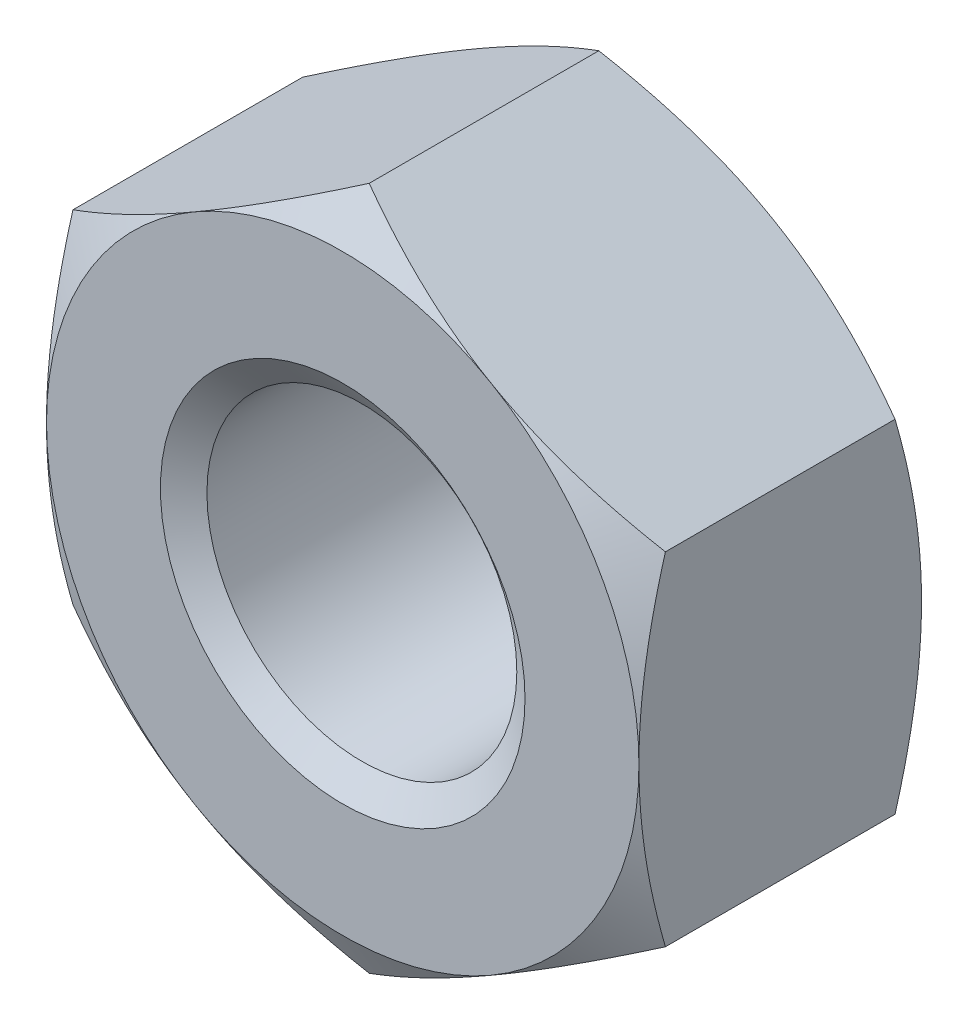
ISO-10303-21;
HEADER;
FILE_DESCRIPTION(('STEP AP214'),'2;1');
FILE_NAME('part.step','',(''),(''),'','','');
FILE_SCHEMA(('AUTOMOTIVE_DESIGN { 1 0 10303 214 1 1 1 1 }'));
ENDSEC;
DATA;
#1=APPLICATION_CONTEXT('core data for automotive mechanical design processes');
#2=APPLICATION_PROTOCOL_DEFINITION('international standard','automotive_design',2000,#1);
#3=PRODUCT_CONTEXT('',#1,'mechanical');
#4=PRODUCT('Part','Part','',(#3));
#5=PRODUCT_RELATED_PRODUCT_CATEGORY('part','',(#4));
#6=PRODUCT_DEFINITION_FORMATION('','',#4);
#7=PRODUCT_DEFINITION_CONTEXT('part definition',#1,'design');
#8=PRODUCT_DEFINITION('design','',#6,#7);
#9=PRODUCT_DEFINITION_SHAPE('','',#8);
#10=(LENGTH_UNIT() NAMED_UNIT(*) SI_UNIT(.MILLI.,.METRE.));
#11=(NAMED_UNIT(*) PLANE_ANGLE_UNIT() SI_UNIT($,.RADIAN.));
#12=(NAMED_UNIT(*) SI_UNIT($,.STERADIAN.) SOLID_ANGLE_UNIT());
#13=UNCERTAINTY_MEASURE_WITH_UNIT(LENGTH_MEASURE(1.E-05),#10,'distance_accuracy_value','');
#14=(GEOMETRIC_REPRESENTATION_CONTEXT(3) GLOBAL_UNCERTAINTY_ASSIGNED_CONTEXT((#13)) GLOBAL_UNIT_ASSIGNED_CONTEXT((#10,
#11,#12)) REPRESENTATION_CONTEXT('',''));
#15=CARTESIAN_POINT('',(0.,0.,0.));
#16=DIRECTION('',(0.,0.,1.));
#17=DIRECTION('',(1.,0.,0.));
#18=AXIS2_PLACEMENT_3D('',#15,#16,#17);
#19=CARTESIAN_POINT('',(0.,0.,-6.2));
#20=DIRECTION('',(0.,0.,1.));
#21=DIRECTION('',(1.,0.,0.));
#22=AXIS2_PLACEMENT_3D('',#19,#20,#21);
#23=CYLINDRICAL_SURFACE('',#22,3.4);
#24=CARTESIAN_POINT('',(0.,0.,-0.420124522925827));
#25=DIRECTION('',(0.,0.,1.));
#26=DIRECTION('',(1.,0.,0.));
#27=AXIS2_PLACEMENT_3D('',#24,#25,#26);
#28=CIRCLE('',#27,3.4);
#29=CARTESIAN_POINT('',(3.4,0.,-0.420124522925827));
#30=VERTEX_POINT('',#29);
#31=EDGE_CURVE('E175',#30,#30,#28,.F.);
#32=CARTESIAN_POINT('',(0.,0.,-5.75447547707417));
#33=DIRECTION('',(0.,0.,-1.));
#34=DIRECTION('',(-1.,0.,0.));
#35=AXIS2_PLACEMENT_3D('',#32,#33,#34);
#36=CIRCLE('',#35,3.4);
#37=CARTESIAN_POINT('',(3.4,0.,-5.75447547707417));
#38=VERTEX_POINT('',#37);
#39=EDGE_CURVE('E40',#38,#38,#36,.F.);
#40=CARTESIAN_POINT('',(3.4,0.,-0.420124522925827));
#41=CARTESIAN_POINT('',(3.4,0.,-0.475690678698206));
#42=CARTESIAN_POINT('',(3.4,0.,-0.531256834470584));
#43=CARTESIAN_POINT('',(3.4,0.,-0.642389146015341));
#44=CARTESIAN_POINT('',(3.4,0.,-0.69795530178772));
#45=CARTESIAN_POINT('',(3.4,0.,-0.809087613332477));
#46=CARTESIAN_POINT('',(3.4,0.,-0.864653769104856));
#47=CARTESIAN_POINT('',(3.4,0.,-0.975786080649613));
#48=CARTESIAN_POINT('',(3.4,0.,-1.03135223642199));
#49=CARTESIAN_POINT('',(3.4,0.,-1.14248454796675));
#50=CARTESIAN_POINT('',(3.4,0.,-1.19805070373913));
#51=CARTESIAN_POINT('',(3.4,0.,-1.30918301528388));
#52=CARTESIAN_POINT('',(3.4,0.,-1.36474917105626));
#53=CARTESIAN_POINT('',(3.4,0.,-1.47588148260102));
#54=CARTESIAN_POINT('',(3.4,0.,-1.5314476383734));
#55=CARTESIAN_POINT('',(3.4,0.,-1.64257994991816));
#56=CARTESIAN_POINT('',(3.4,0.,-1.69814610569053));
#57=CARTESIAN_POINT('',(3.4,0.,-1.80927841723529));
#58=CARTESIAN_POINT('',(3.4,0.,-1.86484457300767));
#59=CARTESIAN_POINT('',(3.4,0.,-1.97597688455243));
#60=CARTESIAN_POINT('',(3.4,0.,-2.03154304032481));
#61=CARTESIAN_POINT('',(3.4,0.,-2.14267535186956));
#62=CARTESIAN_POINT('',(3.4,0.,-2.19824150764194));
#63=CARTESIAN_POINT('',(3.4,0.,-2.3093738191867));
#64=CARTESIAN_POINT('',(3.4,0.,-2.36493997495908));
#65=CARTESIAN_POINT('',(3.4,0.,-2.47607228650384));
#66=CARTESIAN_POINT('',(3.4,0.,-2.53163844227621));
#67=CARTESIAN_POINT('',(3.4,0.,-2.64277075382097));
#68=CARTESIAN_POINT('',(3.4,0.,-2.69833690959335));
#69=CARTESIAN_POINT('',(3.4,0.,-2.80946922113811));
#70=CARTESIAN_POINT('',(3.4,0.,-2.86503537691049));
#71=CARTESIAN_POINT('',(3.4,0.,-2.97616768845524));
#72=CARTESIAN_POINT('',(3.4,0.,-3.03173384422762));
#73=CARTESIAN_POINT('',(3.4,0.,-3.14286615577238));
#74=CARTESIAN_POINT('',(3.4,0.,-3.19843231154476));
#75=CARTESIAN_POINT('',(3.4,0.,-3.30956462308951));
#76=CARTESIAN_POINT('',(3.4,0.,-3.36513077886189));
#77=CARTESIAN_POINT('',(3.4,0.,-3.47626309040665));
#78=CARTESIAN_POINT('',(3.4,0.,-3.53182924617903));
#79=CARTESIAN_POINT('',(3.4,0.,-3.64296155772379));
#80=CARTESIAN_POINT('',(3.4,0.,-3.69852771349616));
#81=CARTESIAN_POINT('',(3.4,0.,-3.80966002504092));
#82=CARTESIAN_POINT('',(3.4,0.,-3.8652261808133));
#83=CARTESIAN_POINT('',(3.4,0.,-3.97635849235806));
#84=CARTESIAN_POINT('',(3.4,0.,-4.03192464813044));
#85=CARTESIAN_POINT('',(3.4,0.,-4.14305695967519));
#86=CARTESIAN_POINT('',(3.4,0.,-4.19862311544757));
#87=CARTESIAN_POINT('',(3.4,0.,-4.30975542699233));
#88=CARTESIAN_POINT('',(3.4,0.,-4.36532158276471));
#89=CARTESIAN_POINT('',(3.4,0.,-4.47645389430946));
#90=CARTESIAN_POINT('',(3.4,0.,-4.53202005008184));
#91=CARTESIAN_POINT('',(3.4,0.,-4.6431523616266));
#92=CARTESIAN_POINT('',(3.4,0.,-4.69871851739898));
#93=CARTESIAN_POINT('',(3.4,0.,-4.80985082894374));
#94=CARTESIAN_POINT('',(3.4,0.,-4.86541698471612));
#95=CARTESIAN_POINT('',(3.4,0.,-4.97654929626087));
#96=CARTESIAN_POINT('',(3.4,0.,-5.03211545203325));
#97=CARTESIAN_POINT('',(3.4,0.,-5.14324776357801));
#98=CARTESIAN_POINT('',(3.4,0.,-5.19881391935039));
#99=CARTESIAN_POINT('',(3.4,0.,-5.30994623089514));
#100=CARTESIAN_POINT('',(3.4,0.,-5.36551238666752));
#101=CARTESIAN_POINT('',(3.4,0.,-5.47664469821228));
#102=CARTESIAN_POINT('',(3.4,0.,-5.53221085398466));
#103=CARTESIAN_POINT('',(3.4,0.,-5.64334316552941));
#104=CARTESIAN_POINT('',(3.4,0.,-5.69890932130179));
#105=CARTESIAN_POINT('',(3.4,0.,-5.75447547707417));
#106=B_SPLINE_CURVE_WITH_KNOTS('',3,(#40,#41,#42,#43,#44,#45,#46,#47,#48,#49,#50,#51,#52,#53,
#54,#55,#56,#57,#58,#59,#60,#61,#62,#63,#64,#65,#66,#67,#68,#69,#70,#71,#72,#73,#74,#75,#76,#77,
#78,#79,#80,#81,#82,#83,#84,#85,#86,#87,#88,#89,#90,#91,#92,#93,#94,#95,#96,#97,#98,#99,#100,
#101,#102,#103,#104,#105),.UNSPECIFIED.,.F.,.F.,(4,2,2,2,2,2,2,2,2,2,2,2,2,2,2,2,2,2,2,2,2,2,2,
2,2,2,2,2,2,2,2,2,4),(0.,0.166698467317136,0.333396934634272,0.500095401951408,
0.666793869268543,0.833492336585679,1.00019080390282,1.16688927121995,1.33358773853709,
1.50028620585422,1.66698467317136,1.83368314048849,2.00038160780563,2.16708007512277,
2.3337785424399,2.50047700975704,2.66717547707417,2.83387394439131,3.00057241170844,
3.16727087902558,3.33396934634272,3.50066781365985,3.66736628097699,3.83406474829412,
4.00076321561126,4.1674616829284,4.33416015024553,4.50085861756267,4.6675570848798,
4.83425555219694,5.00095401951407,5.16765248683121,5.33435095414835),.UNSPECIFIED.);
#107=EDGE_CURVE('BSEAM35',#30,#38,#106,.T.);
#108=ORIENTED_EDGE('',*,*,#31,.F.);
#109=ORIENTED_EDGE('',*,*,#39,.F.);
#110=ORIENTED_EDGE('',*,*,#107,.T.);
#111=ORIENTED_EDGE('',*,*,#107,.F.);
#112=EDGE_LOOP('',(#108,#110,#109,#111));
#113=FACE_BOUND('',#112,.T.);
#114=ADVANCED_FACE('F35',(#113),#23,.F.);
#115=CARTESIAN_POINT('',(0.,7.50555349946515,-6.2));
#116=DIRECTION('',(0.,0.,-1.));
#117=DIRECTION('',(-1.,0.,0.));
#118=AXIS2_PLACEMENT_3D('',#115,#116,#117);
#119=PLANE('',#118);
#120=CARTESIAN_POINT('',(0.,0.,-6.2));
#121=DIRECTION('',(0.,0.,-1.));
#122=DIRECTION('',(-1.,0.,0.));
#123=AXIS2_PLACEMENT_3D('',#120,#121,#122);
#124=CIRCLE('',#123,6.5);
#125=CARTESIAN_POINT('',(-6.5,0.,-6.2));
#126=VERTEX_POINT('',#125);
#127=CARTESIAN_POINT('',(-3.25000000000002,-5.62916512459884,-6.2));
#128=VERTEX_POINT('',#127);
#129=EDGE_CURVE('E171',#126,#128,#124,.F.);
#130=ORIENTED_EDGE('',*,*,#129,.F.);
#131=CARTESIAN_POINT('',(-3.25000000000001,5.62916512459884,-6.2));
#132=VERTEX_POINT('',#131);
#133=EDGE_CURVE('E153',#132,#126,#124,.F.);
#134=ORIENTED_EDGE('',*,*,#133,.F.);
#135=CARTESIAN_POINT('',(3.25000000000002,5.62916512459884,-6.2));
#136=VERTEX_POINT('',#135);
#137=EDGE_CURVE('E170',#136,#132,#124,.F.);
#138=ORIENTED_EDGE('',*,*,#137,.F.);
#139=CARTESIAN_POINT('',(0.,0.,-6.2));
#140=DIRECTION('',(0.,0.,1.));
#141=DIRECTION('',(1.,0.,0.));
#142=AXIS2_PLACEMENT_3D('',#139,#140,#141);
#143=CIRCLE('',#142,6.5);
#144=CARTESIAN_POINT('',(6.5,0.,-6.2));
#145=VERTEX_POINT('',#144);
#146=EDGE_CURVE('E245',#145,#136,#143,.T.);
#147=ORIENTED_EDGE('',*,*,#146,.F.);
#148=CARTESIAN_POINT('',(3.25000000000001,-5.62916512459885,-6.2));
#149=VERTEX_POINT('',#148);
#150=EDGE_CURVE('E377',#149,#145,#124,.F.);
#151=ORIENTED_EDGE('',*,*,#150,.F.);
#152=EDGE_CURVE('E398',#128,#149,#124,.F.);
#153=ORIENTED_EDGE('',*,*,#152,.F.);
#154=EDGE_LOOP('',(#130,#134,#138,#147,#151,#153));
#155=FACE_BOUND('',#154,.T.);
#156=CARTESIAN_POINT('',(0.,0.,-6.2));
#157=DIRECTION('',(0.,0.,-1.));
#158=DIRECTION('',(-1.,0.,0.));
#159=AXIS2_PLACEMENT_3D('',#156,#157,#158);
#160=CIRCLE('',#159,4.);
#161=CARTESIAN_POINT('',(-4.,0.,-6.2));
#162=VERTEX_POINT('',#161);
#163=EDGE_CURVE('E178',#162,#162,#160,.F.);
#164=ORIENTED_EDGE('',*,*,#163,.T.);
#165=EDGE_LOOP('',(#164));
#166=FACE_BOUND('',#165,.T.);
#167=ADVANCED_FACE('F250',(#155,#166),#119,.T.);
#168=CARTESIAN_POINT('',(0.,7.50555349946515,0.));
#169=DIRECTION('',(0.,0.,-1.));
#170=DIRECTION('',(-1.,0.,0.));
#171=AXIS2_PLACEMENT_3D('',#168,#169,#170);
#172=PLANE('',#171);
#173=CARTESIAN_POINT('',(0.,0.,0.));
#174=DIRECTION('',(0.,0.,-1.));
#175=DIRECTION('',(-1.,0.,0.));
#176=AXIS2_PLACEMENT_3D('',#173,#174,#175);
#177=CIRCLE('',#176,6.5);
#178=CARTESIAN_POINT('',(-6.5,0.,0.));
#179=VERTEX_POINT('',#178);
#180=CARTESIAN_POINT('',(-3.25000000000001,5.62916512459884,0.));
#181=VERTEX_POINT('',#180);
#182=EDGE_CURVE('E11',#179,#181,#177,.T.);
#183=ORIENTED_EDGE('',*,*,#182,.F.);
#184=CARTESIAN_POINT('',(-3.25000000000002,-5.62916512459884,0.));
#185=VERTEX_POINT('',#184);
#186=EDGE_CURVE('E47',#185,#179,#177,.T.);
#187=ORIENTED_EDGE('',*,*,#186,.F.);
#188=CARTESIAN_POINT('',(3.25000000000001,-5.62916512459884,0.));
#189=VERTEX_POINT('',#188);
#190=EDGE_CURVE('E174',#189,#185,#177,.T.);
#191=ORIENTED_EDGE('',*,*,#190,.F.);
#192=CARTESIAN_POINT('',(6.5,0.,0.));
#193=VERTEX_POINT('',#192);
#194=EDGE_CURVE('E343',#193,#189,#177,.T.);
#195=ORIENTED_EDGE('',*,*,#194,.F.);
#196=CARTESIAN_POINT('',(0.,0.,0.));
#197=DIRECTION('',(0.,0.,1.));
#198=DIRECTION('',(1.,0.,0.));
#199=AXIS2_PLACEMENT_3D('',#196,#197,#198);
#200=CIRCLE('',#199,6.5);
#201=CARTESIAN_POINT('',(3.25000000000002,5.62916512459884,0.));
#202=VERTEX_POINT('',#201);
#203=EDGE_CURVE('E129',#193,#202,#200,.T.);
#204=ORIENTED_EDGE('',*,*,#203,.T.);
#205=EDGE_CURVE('E45',#181,#202,#177,.T.);
#206=ORIENTED_EDGE('',*,*,#205,.F.);
#207=EDGE_LOOP('',(#183,#187,#191,#195,#204,#206));
#208=FACE_BOUND('',#207,.T.);
#209=CARTESIAN_POINT('',(0.,0.,0.));
#210=DIRECTION('',(0.,0.,1.));
#211=DIRECTION('',(1.,0.,0.));
#212=AXIS2_PLACEMENT_3D('',#209,#210,#211);
#213=CIRCLE('',#212,4.);
#214=CARTESIAN_POINT('',(4.,0.,0.));
#215=VERTEX_POINT('',#214);
#216=EDGE_CURVE('E177',#215,#215,#213,.T.);
#217=ORIENTED_EDGE('',*,*,#216,.F.);
#218=EDGE_LOOP('',(#217));
#219=FACE_BOUND('',#218,.T.);
#220=ADVANCED_FACE('F302',(#208,#219),#172,.F.);
#221=CARTESIAN_POINT('',(0.,7.50555349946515,-6.2));
#222=DIRECTION('',(-0.500000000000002,0.866025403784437,0.));
#223=DIRECTION('',(-0.866025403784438,-0.500000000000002,0.));
#224=AXIS2_PLACEMENT_3D('',#221,#222,#223);
#225=PLANE('',#224);
#226=DIRECTION('',(0.,0.,1.));
#227=VECTOR('',#226,1.);
#228=CARTESIAN_POINT('',(-6.5,3.75277674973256,-6.2));
#229=LINE('',#228,#227);
#230=CARTESIAN_POINT('',(-6.5,3.7527767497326,-5.61944341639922));
#231=VERTEX_POINT('',#230);
#232=CARTESIAN_POINT('',(-6.5,3.75277674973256,-0.580556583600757));
#233=VERTEX_POINT('',#232);
#234=EDGE_CURVE('E165',#231,#233,#229,.T.);
#235=ORIENTED_EDGE('',*,*,#234,.T.);
#236=CARTESIAN_POINT('',(-6.5002,3.75266127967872,-0.580623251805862));
#237=CARTESIAN_POINT('',(-6.35732254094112,3.83515161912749,-0.53300442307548));
#238=CARTESIAN_POINT('',(-6.21391236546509,3.91794952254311,-0.487546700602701));
#239=CARTESIAN_POINT('',(-5.9259273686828,4.08421773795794,-0.401548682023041));
#240=CARTESIAN_POINT('',(-5.78135207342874,4.16768832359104,-0.361010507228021));
#241=CARTESIAN_POINT('',(-5.34531134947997,4.41943655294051,-0.247571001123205));
#242=CARTESIAN_POINT('',(-5.05212471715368,4.58870793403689,-0.183047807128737));
#243=CARTESIAN_POINT('',(-4.61337625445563,4.84201947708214,-0.10738658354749));
#244=CARTESIAN_POINT('',(-4.46912536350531,4.92530276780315,-0.085832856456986));
#245=CARTESIAN_POINT('',(-4.17997178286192,5.09224566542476,-0.0496903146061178));
#246=CARTESIAN_POINT('',(-4.03506915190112,5.17590523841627,-0.0351008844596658));
#247=CARTESIAN_POINT('',(-3.74501222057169,5.34336968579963,-0.0132587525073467));
#248=CARTESIAN_POINT('',(-3.5998583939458,5.42717428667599,-0.00599772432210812));
#249=CARTESIAN_POINT('',(-3.30942466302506,5.59485627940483,0.00103969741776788));
#250=CARTESIAN_POINT('',(-3.16414476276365,5.6787336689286,0.000816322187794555));
#251=CARTESIAN_POINT('',(-2.76612405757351,5.90853103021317,-0.0100834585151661));
#252=CARTESIAN_POINT('',(-2.51351353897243,6.05437578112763,-0.0283818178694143));
#253=CARTESIAN_POINT('',(-2.00997032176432,6.34509659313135,-0.0864063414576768));
#254=CARTESIAN_POINT('',(-1.75903939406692,6.48997163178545,-0.126152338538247));
#255=CARTESIAN_POINT('',(-1.25448277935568,6.78127752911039,-0.225505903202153));
#256=CARTESIAN_POINT('',(-1.00092075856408,6.92767163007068,-0.28553442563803));
#257=CARTESIAN_POINT('',(-0.49757806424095,7.21827667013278,-0.421774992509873));
#258=CARTESIAN_POINT('',(-0.24779094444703,7.3624913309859,-0.497955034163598));
#259=CARTESIAN_POINT('',(0.000200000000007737,7.50566896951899,-0.580623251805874));
#260=B_SPLINE_CURVE_WITH_KNOTS('',3,(#236,#237,#238,#239,#240,#241,#242,#243,#244,#245,#246,
#247,#248,#249,#250,#251,#252,#253,#254,#255,#256,#257,#258,#259),.UNSPECIFIED.,.F.,.F.,(4,2,2,
2,2,2,2,2,2,2,2,4),(0.,0.515105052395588,1.03043143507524,2.06322554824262,2.56697389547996,
3.07067772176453,3.57380860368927,4.0769239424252,4.9527935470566,5.82947446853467,
6.72559912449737,7.61996451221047),.UNSPECIFIED.);
#261=EDGE_CURVE('E134',#233,#181,#260,.T.);
#262=ORIENTED_EDGE('',*,*,#261,.T.);
#263=CARTESIAN_POINT('',(0.,7.50555349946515,-0.58055658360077));
#264=VERTEX_POINT('',#263);
#265=EDGE_CURVE('E54',#181,#264,#260,.T.);
#266=ORIENTED_EDGE('',*,*,#265,.T.);
#267=DIRECTION('',(0.,0.,1.));
#268=VECTOR('',#267,1.);
#269=CARTESIAN_POINT('',(0.,7.50555349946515,-6.2));
#270=LINE('',#269,#268);
#271=CARTESIAN_POINT('',(0.,7.50555349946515,-5.61944341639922));
#272=VERTEX_POINT('',#271);
#273=EDGE_CURVE('E150',#272,#264,#270,.T.);
#274=ORIENTED_EDGE('',*,*,#273,.F.);
#275=CARTESIAN_POINT('',(-6.5002,3.75266127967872,-5.61937674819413));
#276=CARTESIAN_POINT('',(-6.35732254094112,3.83515161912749,-5.66699557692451));
#277=CARTESIAN_POINT('',(-6.21391236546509,3.91794952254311,-5.71245329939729));
#278=CARTESIAN_POINT('',(-5.9259273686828,4.08421773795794,-5.79845131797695));
#279=CARTESIAN_POINT('',(-5.78135207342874,4.16768832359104,-5.83898949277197));
#280=CARTESIAN_POINT('',(-5.34531134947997,4.41943655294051,-5.95242899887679));
#281=CARTESIAN_POINT('',(-5.05212471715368,4.58870793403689,-6.01695219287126));
#282=CARTESIAN_POINT('',(-4.61337625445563,4.84201947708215,-6.09261341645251));
#283=CARTESIAN_POINT('',(-4.46912536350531,4.92530276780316,-6.11416714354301));
#284=CARTESIAN_POINT('',(-4.17997178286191,5.09224566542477,-6.15030968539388));
#285=CARTESIAN_POINT('',(-4.03506915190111,5.17590523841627,-6.16489911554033));
#286=CARTESIAN_POINT('',(-3.74501222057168,5.34336968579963,-6.18674124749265));
#287=CARTESIAN_POINT('',(-3.59985839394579,5.427174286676,-6.19400227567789));
#288=CARTESIAN_POINT('',(-3.30942466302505,5.59485627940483,-6.20103969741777));
#289=CARTESIAN_POINT('',(-3.16414476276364,5.6787336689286,-6.2008163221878));
#290=CARTESIAN_POINT('',(-2.76612405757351,5.90853103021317,-6.18991654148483));
#291=CARTESIAN_POINT('',(-2.51351353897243,6.05437578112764,-6.17161818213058));
#292=CARTESIAN_POINT('',(-2.00997032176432,6.34509659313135,-6.11359365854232));
#293=CARTESIAN_POINT('',(-1.75903939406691,6.48997163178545,-6.07384766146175));
#294=CARTESIAN_POINT('',(-1.25448277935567,6.78127752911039,-5.97449409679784));
#295=CARTESIAN_POINT('',(-1.00092075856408,6.92767163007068,-5.91446557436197));
#296=CARTESIAN_POINT('',(-0.497578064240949,7.21827667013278,-5.77822500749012));
#297=CARTESIAN_POINT('',(-0.247790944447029,7.3624913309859,-5.7020449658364));
#298=CARTESIAN_POINT('',(0.000200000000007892,7.50566896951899,-5.61937674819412));
#299=B_SPLINE_CURVE_WITH_KNOTS('',3,(#275,#276,#277,#278,#279,#280,#281,#282,#283,#284,#285,
#286,#287,#288,#289,#290,#291,#292,#293,#294,#295,#296,#297,#298),.UNSPECIFIED.,.F.,.F.,(4,2,2,
2,2,2,2,2,2,2,2,4),(0.,0.515105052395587,1.03043143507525,2.06322554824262,2.56697389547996,
3.07067772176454,3.57380860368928,4.0769239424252,4.95279354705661,5.82947446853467,
6.72559912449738,7.61996451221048),.UNSPECIFIED.);
#300=EDGE_CURVE('E168',#132,#272,#299,.T.);
#301=ORIENTED_EDGE('',*,*,#300,.F.);
#302=EDGE_CURVE('E260',#231,#132,#299,.T.);
#303=ORIENTED_EDGE('',*,*,#302,.F.);
#304=EDGE_LOOP('',(#235,#262,#266,#274,#301,#303));
#305=FACE_BOUND('',#304,.T.);
#306=ADVANCED_FACE('F37',(#305),#225,.T.);
#307=CARTESIAN_POINT('',(6.5,3.75277674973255,-6.2));
#308=DIRECTION('',(0.500000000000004,0.866025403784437,0.));
#309=DIRECTION('',(-0.866025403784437,0.500000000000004,0.));
#310=AXIS2_PLACEMENT_3D('',#307,#308,#309);
#311=PLANE('',#310);
#312=ORIENTED_EDGE('',*,*,#273,.T.);
#313=CARTESIAN_POINT('',(-0.000199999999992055,7.50566896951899,-0.580623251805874));
#314=CARTESIAN_POINT('',(0.142677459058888,7.42317863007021,-0.533004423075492));
#315=CARTESIAN_POINT('',(0.28608763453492,7.34038072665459,-0.487546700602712));
#316=CARTESIAN_POINT('',(0.574072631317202,7.17411251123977,-0.401548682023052));
#317=CARTESIAN_POINT('',(0.718647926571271,7.09064192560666,-0.361010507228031));
#318=CARTESIAN_POINT('',(1.15468865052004,6.8388936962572,-0.247571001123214));
#319=CARTESIAN_POINT('',(1.44787528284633,6.66962231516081,-0.183047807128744));
#320=CARTESIAN_POINT('',(1.88662374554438,6.41631077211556,-0.107386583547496));
#321=CARTESIAN_POINT('',(2.0308746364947,6.33302748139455,-0.0858328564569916));
#322=CARTESIAN_POINT('',(2.32002821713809,6.16608458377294,-0.0496903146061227));
#323=CARTESIAN_POINT('',(2.46493084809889,6.08242501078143,-0.0351008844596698));
#324=CARTESIAN_POINT('',(2.75498777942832,5.91496056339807,-0.0132587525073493));
#325=CARTESIAN_POINT('',(2.90014160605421,5.8311559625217,-0.00599772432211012));
#326=CARTESIAN_POINT('',(3.19057533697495,5.66347396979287,0.00103969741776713));
#327=CARTESIAN_POINT('',(3.33585523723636,5.5795965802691,0.00081632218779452));
#328=CARTESIAN_POINT('',(3.7338759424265,5.34979921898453,-0.0100834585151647));
#329=CARTESIAN_POINT('',(3.98648646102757,5.20395446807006,-0.0283818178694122));
#330=CARTESIAN_POINT('',(4.49002967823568,4.91323365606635,-0.0864063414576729));
#331=CARTESIAN_POINT('',(4.74096060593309,4.76835861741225,-0.126152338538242));
#332=CARTESIAN_POINT('',(5.24551722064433,4.4770527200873,-0.225505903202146));
#333=CARTESIAN_POINT('',(5.49907924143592,4.33065861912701,-0.285534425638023));
#334=CARTESIAN_POINT('',(6.00242193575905,4.04005357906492,-0.421774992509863));
#335=CARTESIAN_POINT('',(6.25220905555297,3.8958389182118,-0.497955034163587));
#336=CARTESIAN_POINT('',(6.5002,3.75266127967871,-0.580623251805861));
#337=B_SPLINE_CURVE_WITH_KNOTS('',3,(#313,#314,#315,#316,#317,#318,#319,#320,#321,#322,#323,
#324,#325,#326,#327,#328,#329,#330,#331,#332,#333,#334,#335,#336),.UNSPECIFIED.,.F.,.F.,(4,2,2,
2,2,2,2,2,2,2,2,4),(0.,0.515105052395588,1.03043143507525,2.06322554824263,2.56697389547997,
3.07067772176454,3.57380860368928,4.07692394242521,4.95279354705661,5.82947446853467,
6.72559912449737,7.61996451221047),.UNSPECIFIED.);
#338=EDGE_CURVE('E144',#264,#202,#337,.T.);
#339=ORIENTED_EDGE('',*,*,#338,.T.);
#340=CARTESIAN_POINT('',(6.5,3.75277674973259,-0.58055658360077));
#341=VERTEX_POINT('',#340);
#342=EDGE_CURVE('E61',#202,#341,#337,.T.);
#343=ORIENTED_EDGE('',*,*,#342,.T.);
#344=DIRECTION('',(0.,0.,1.));
#345=VECTOR('',#344,1.);
#346=CARTESIAN_POINT('',(6.5,3.75277674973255,-6.2));
#347=LINE('',#346,#345);
#348=CARTESIAN_POINT('',(6.5,3.75277674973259,-5.61944341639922));
#349=VERTEX_POINT('',#348);
#350=EDGE_CURVE('E143',#349,#341,#347,.T.);
#351=ORIENTED_EDGE('',*,*,#350,.F.);
#352=CARTESIAN_POINT('',(-0.000199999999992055,7.50566896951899,-5.61937674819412));
#353=CARTESIAN_POINT('',(0.142677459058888,7.42317863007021,-5.6669955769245));
#354=CARTESIAN_POINT('',(0.286087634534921,7.34038072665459,-5.71245329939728));
#355=CARTESIAN_POINT('',(0.574072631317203,7.17411251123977,-5.79845131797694));
#356=CARTESIAN_POINT('',(0.718647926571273,7.09064192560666,-5.83898949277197));
#357=CARTESIAN_POINT('',(1.15468865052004,6.8388936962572,-5.95242899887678));
#358=CARTESIAN_POINT('',(1.44787528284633,6.66962231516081,-6.01695219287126));
#359=CARTESIAN_POINT('',(1.88662374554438,6.41631077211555,-6.0926134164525));
#360=CARTESIAN_POINT('',(2.0308746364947,6.33302748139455,-6.11416714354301));
#361=CARTESIAN_POINT('',(2.3200282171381,6.16608458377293,-6.15030968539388));
#362=CARTESIAN_POINT('',(2.4649308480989,6.08242501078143,-6.16489911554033));
#363=CARTESIAN_POINT('',(2.75498777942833,5.91496056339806,-6.18674124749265));
#364=CARTESIAN_POINT('',(2.90014160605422,5.8311559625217,-6.19400227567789));
#365=CARTESIAN_POINT('',(3.19057533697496,5.66347396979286,-6.20103969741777));
#366=CARTESIAN_POINT('',(3.33585523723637,5.5795965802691,-6.2008163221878));
#367=CARTESIAN_POINT('',(3.7338759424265,5.34979921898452,-6.18991654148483));
#368=CARTESIAN_POINT('',(3.98648646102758,5.20395446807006,-6.17161818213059));
#369=CARTESIAN_POINT('',(4.49002967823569,4.91323365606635,-6.11359365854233));
#370=CARTESIAN_POINT('',(4.74096060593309,4.76835861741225,-6.07384766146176));
#371=CARTESIAN_POINT('',(5.24551722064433,4.4770527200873,-5.97449409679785));
#372=CARTESIAN_POINT('',(5.49907924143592,4.33065861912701,-5.91446557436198));
#373=CARTESIAN_POINT('',(6.00242193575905,4.04005357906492,-5.77822500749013));
#374=CARTESIAN_POINT('',(6.25220905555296,3.8958389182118,-5.70204496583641));
#375=CARTESIAN_POINT('',(6.5002,3.75266127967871,-5.61937674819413));
#376=B_SPLINE_CURVE_WITH_KNOTS('',3,(#352,#353,#354,#355,#356,#357,#358,#359,#360,#361,#362,
#363,#364,#365,#366,#367,#368,#369,#370,#371,#372,#373,#374,#375),.UNSPECIFIED.,.F.,.F.,(4,2,2,
2,2,2,2,2,2,2,2,4),(0.,0.515105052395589,1.03043143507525,2.06322554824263,2.56697389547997,
3.07067772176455,3.57380860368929,4.07692394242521,4.95279354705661,5.82947446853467,
6.72559912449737,7.61996451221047),.UNSPECIFIED.);
#377=EDGE_CURVE('E254',#136,#349,#376,.T.);
#378=ORIENTED_EDGE('',*,*,#377,.F.);
#379=EDGE_CURVE('E259',#272,#136,#376,.T.);
#380=ORIENTED_EDGE('',*,*,#379,.F.);
#381=EDGE_LOOP('',(#312,#339,#343,#351,#378,#380));
#382=FACE_BOUND('',#381,.T.);
#383=ADVANCED_FACE('F141',(#382),#311,.T.);
#384=CARTESIAN_POINT('',(6.5,3.75277674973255,-6.2));
#385=DIRECTION('',(-1.,0.,0.));
#386=DIRECTION('',(0.,0.,1.));
#387=AXIS2_PLACEMENT_3D('',#384,#385,#386);
#388=PLANE('',#387);
#389=CARTESIAN_POINT('',(6.5,-9.95291698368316,-3.11042358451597));
#390=CARTESIAN_POINT('',(6.5,-9.66753022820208,-2.97250893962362));
#391=CARTESIAN_POINT('',(6.5,-9.38146872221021,-2.83596528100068));
#392=CARTESIAN_POINT('',(6.5,-8.80763137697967,-2.56640336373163));
#393=CARTESIAN_POINT('',(6.5,-8.51985525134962,-2.43338571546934));
#394=CARTESIAN_POINT('',(6.5,-7.94066929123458,-2.17095850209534));
#395=CARTESIAN_POINT('',(6.5,-7.64924808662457,-2.04157394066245));
#396=CARTESIAN_POINT('',(6.5,-7.06401043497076,-1.78836220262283));
#397=CARTESIAN_POINT('',(6.5,-6.77019411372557,-1.66453473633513));
#398=CARTESIAN_POINT('',(6.5,-6.1760515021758,-1.42244480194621));
#399=CARTESIAN_POINT('',(6.5,-5.87568957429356,-1.30426931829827));
#400=CARTESIAN_POINT('',(6.5,-5.27142269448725,-1.07717389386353));
#401=CARTESIAN_POINT('',(6.5,-4.96751735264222,-0.968254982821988));
#402=CARTESIAN_POINT('',(6.5,-4.35630541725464,-0.762599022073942));
#403=CARTESIAN_POINT('',(6.5,-4.04900762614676,-0.665836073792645));
#404=CARTESIAN_POINT('',(6.5,-3.43004022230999,-0.48763571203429));
#405=CARTESIAN_POINT('',(6.5,-3.11837202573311,-0.406193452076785));
#406=CARTESIAN_POINT('',(6.5,-2.49046594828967,-0.262584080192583));
#407=CARTESIAN_POINT('',(6.5,-2.17422687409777,-0.200422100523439));
#408=CARTESIAN_POINT('',(6.5,-1.53789167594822,-0.0995742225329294));
#409=CARTESIAN_POINT('',(6.5,-1.21779554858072,-0.0608883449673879));
#410=CARTESIAN_POINT('',(6.5,-0.737141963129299,-0.022946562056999));
#411=CARTESIAN_POINT('',(6.5,-0.57733688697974,-0.0136452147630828));
#412=CARTESIAN_POINT('',(6.5,-0.257468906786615,-0.00181408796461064));
#413=CARTESIAN_POINT('',(6.5,-0.0974060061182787,0.000715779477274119));
#414=CARTESIAN_POINT('',(6.5,0.222635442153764,-0.00106401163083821));
#415=CARTESIAN_POINT('',(6.5,0.382614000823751,-0.00537175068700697));
#416=CARTESIAN_POINT('',(6.5,0.702250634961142,-0.0207175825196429));
#417=CARTESIAN_POINT('',(6.5,0.861908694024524,-0.0317560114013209));
#418=CARTESIAN_POINT('',(6.5,1.24887053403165,-0.0664368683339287));
#419=CARTESIAN_POINT('',(6.5,1.47587694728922,-0.0934518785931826));
#420=CARTESIAN_POINT('',(6.5,1.92815030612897,-0.159589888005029));
#421=CARTESIAN_POINT('',(6.5,2.15341675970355,-0.198716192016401));
#422=CARTESIAN_POINT('',(6.5,2.6020242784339,-0.287689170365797));
#423=CARTESIAN_POINT('',(6.5,2.82536331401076,-0.337545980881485));
#424=CARTESIAN_POINT('',(6.5,3.26974354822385,-0.446458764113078));
#425=CARTESIAN_POINT('',(6.5,3.49078496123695,-0.505513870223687));
#426=CARTESIAN_POINT('',(6.5,3.93601414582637,-0.632954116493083));
#427=CARTESIAN_POINT('',(6.5,4.16014622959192,-0.701532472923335));
#428=CARTESIAN_POINT('',(6.5,4.6060413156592,-0.845465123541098));
#429=CARTESIAN_POINT('',(6.5,4.82780583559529,-0.920814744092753));
#430=CARTESIAN_POINT('',(6.5,5.26807593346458,-1.07673350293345));
#431=CARTESIAN_POINT('',(6.5,5.48659282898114,-1.15727087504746));
#432=CARTESIAN_POINT('',(6.5,5.92193123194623,-1.32307270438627));
#433=CARTESIAN_POINT('',(6.5,6.1387520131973,-1.40833907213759));
#434=CARTESIAN_POINT('',(6.5,6.35478510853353,-1.49550213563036));
#435=B_SPLINE_CURVE_WITH_KNOTS('',3,(#389,#390,#391,#392,#393,#394,#395,#396,#397,#398,#399,
#400,#401,#402,#403,#404,#405,#406,#407,#408,#409,#410,#411,#412,#413,#414,#415,#416,#417,#418,
#419,#420,#421,#422,#423,#424,#425,#426,#427,#428,#429,#430,#431,#432,#433,#434),.UNSPECIFIED.,
.F.,.F.,(4,2,2,2,2,2,2,2,2,2,2,2,2,2,2,2,2,2,2,2,2,2,4),(0.,0.95090416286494,1.90197187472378,
2.85848216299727,3.81494253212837,4.78314526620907,5.75145556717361,6.71766655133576,
7.68357137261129,8.64973308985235,9.61589566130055,10.0960003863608,10.5760988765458,
11.0560626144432,11.5360503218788,12.2214931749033,12.9071232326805,13.5934038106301,
14.2796197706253,14.9826563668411,15.6852113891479,16.3838119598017,17.0826968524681),.UNSPECIFIED.);
#436=CARTESIAN_POINT('',(6.5,-3.7527767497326,-0.58055658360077));
#437=VERTEX_POINT('',#436);
#438=EDGE_CURVE('E136',#437,#193,#435,.T.);
#439=ORIENTED_EDGE('',*,*,#438,.F.);
#440=DIRECTION('',(0.,0.,1.));
#441=VECTOR('',#440,1.);
#442=CARTESIAN_POINT('',(6.5,-3.7527767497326,-6.2));
#443=LINE('',#442,#441);
#444=CARTESIAN_POINT('',(6.5,-3.7527767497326,-5.61944341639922));
#445=VERTEX_POINT('',#444);
#446=EDGE_CURVE('E151',#445,#437,#443,.T.);
#447=ORIENTED_EDGE('',*,*,#446,.F.);
#448=CARTESIAN_POINT('',(6.5,-9.95291698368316,-3.08957641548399));
#449=CARTESIAN_POINT('',(6.5,-9.66753022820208,-3.22749106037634));
#450=CARTESIAN_POINT('',(6.5,-9.38146872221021,-3.36403471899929));
#451=CARTESIAN_POINT('',(6.5,-8.80763137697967,-3.63359663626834));
#452=CARTESIAN_POINT('',(6.5,-8.51985525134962,-3.76661428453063));
#453=CARTESIAN_POINT('',(6.5,-7.94066929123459,-4.02904149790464));
#454=CARTESIAN_POINT('',(6.5,-7.64924808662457,-4.15842605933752));
#455=CARTESIAN_POINT('',(6.5,-7.06401043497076,-4.41163779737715));
#456=CARTESIAN_POINT('',(6.5,-6.77019411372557,-4.53546526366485));
#457=CARTESIAN_POINT('',(6.5,-6.1760515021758,-4.77755519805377));
#458=CARTESIAN_POINT('',(6.5,-5.87568957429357,-4.89573068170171));
#459=CARTESIAN_POINT('',(6.5,-5.27142269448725,-5.12282610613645));
#460=CARTESIAN_POINT('',(6.5,-4.96751735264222,-5.231745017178));
#461=CARTESIAN_POINT('',(6.5,-4.35630541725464,-5.43740097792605));
#462=CARTESIAN_POINT('',(6.5,-4.04900762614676,-5.53416392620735));
#463=CARTESIAN_POINT('',(6.5,-3.43004022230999,-5.71236428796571));
#464=CARTESIAN_POINT('',(6.5,-3.11837202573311,-5.79380654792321));
#465=CARTESIAN_POINT('',(6.5,-2.49046594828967,-5.93741591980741));
#466=CARTESIAN_POINT('',(6.5,-2.17422687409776,-5.99957789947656));
#467=CARTESIAN_POINT('',(6.5,-1.53789167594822,-6.10042577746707));
#468=CARTESIAN_POINT('',(6.5,-1.21779554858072,-6.13911165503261));
#469=CARTESIAN_POINT('',(6.5,-0.737141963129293,-6.177053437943));
#470=CARTESIAN_POINT('',(6.5,-0.577336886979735,-6.18635478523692));
#471=CARTESIAN_POINT('',(6.5,-0.257468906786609,-6.19818591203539));
#472=CARTESIAN_POINT('',(6.5,-0.0974060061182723,-6.20071577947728));
#473=CARTESIAN_POINT('',(6.5,0.222635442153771,-6.19893598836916));
#474=CARTESIAN_POINT('',(6.5,0.382614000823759,-6.19462824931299));
#475=CARTESIAN_POINT('',(6.5,0.70225063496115,-6.17928241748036));
#476=CARTESIAN_POINT('',(6.5,0.861908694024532,-6.16824398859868));
#477=CARTESIAN_POINT('',(6.5,1.24887053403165,-6.13356313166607));
#478=CARTESIAN_POINT('',(6.5,1.47587694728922,-6.10654812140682));
#479=CARTESIAN_POINT('',(6.5,1.92815030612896,-6.04041011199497));
#480=CARTESIAN_POINT('',(6.5,2.15341675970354,-6.0012838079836));
#481=CARTESIAN_POINT('',(6.5,2.60202427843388,-5.9123108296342));
#482=CARTESIAN_POINT('',(6.5,2.82536331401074,-5.86245401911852));
#483=CARTESIAN_POINT('',(6.5,3.26974354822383,-5.75354123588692));
#484=CARTESIAN_POINT('',(6.5,3.49078496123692,-5.69448612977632));
#485=CARTESIAN_POINT('',(6.5,3.93601414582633,-5.56704588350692));
#486=CARTESIAN_POINT('',(6.5,4.16014622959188,-5.49846752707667));
#487=CARTESIAN_POINT('',(6.5,4.60604131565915,-5.35453487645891));
#488=CARTESIAN_POINT('',(6.5,4.82780583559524,-5.27918525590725));
#489=CARTESIAN_POINT('',(6.5,5.26807593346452,-5.12326649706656));
#490=CARTESIAN_POINT('',(6.5,5.48659282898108,-5.04272912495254));
#491=CARTESIAN_POINT('',(6.5,5.92193123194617,-4.87692729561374));
#492=CARTESIAN_POINT('',(6.5,6.13875201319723,-4.79166092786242));
#493=CARTESIAN_POINT('',(6.5,6.35478510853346,-4.70449786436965));
#494=B_SPLINE_CURVE_WITH_KNOTS('',3,(#448,#449,#450,#451,#452,#453,#454,#455,#456,#457,#458,
#459,#460,#461,#462,#463,#464,#465,#466,#467,#468,#469,#470,#471,#472,#473,#474,#475,#476,#477,
#478,#479,#480,#481,#482,#483,#484,#485,#486,#487,#488,#489,#490,#491,#492,#493),.UNSPECIFIED.,
.F.,.F.,(4,2,2,2,2,2,2,2,2,2,2,2,2,2,2,2,2,2,2,2,2,2,4),(0.,0.950904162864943,1.90197187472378,
2.85848216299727,3.81494253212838,4.78314526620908,5.75145556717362,6.71766655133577,
7.6835713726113,8.64973308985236,9.61589566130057,10.0960003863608,10.5760988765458,
11.0560626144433,11.5360503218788,12.2214931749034,12.9071232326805,13.5934038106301,
14.2796197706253,14.9826563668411,15.6852113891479,16.3838119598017,17.082696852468),.UNSPECIFIED.);
#495=EDGE_CURVE('E266',#445,#145,#494,.T.);
#496=ORIENTED_EDGE('',*,*,#495,.T.);
#497=EDGE_CURVE('E149',#145,#349,#494,.T.);
#498=ORIENTED_EDGE('',*,*,#497,.T.);
#499=ORIENTED_EDGE('',*,*,#350,.T.);
#500=EDGE_CURVE('E126',#193,#341,#435,.T.);
#501=ORIENTED_EDGE('',*,*,#500,.F.);
#502=EDGE_LOOP('',(#439,#447,#496,#498,#499,#501));
#503=FACE_BOUND('',#502,.T.);
#504=ADVANCED_FACE('F147',(#503),#388,.F.);
#505=CARTESIAN_POINT('',(0.,-7.50555349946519,-6.2));
#506=DIRECTION('',(0.500000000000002,-0.866025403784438,0.));
#507=DIRECTION('',(0.866025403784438,0.500000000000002,0.));
#508=AXIS2_PLACEMENT_3D('',#505,#506,#507);
#509=PLANE('',#508);
#510=ORIENTED_EDGE('',*,*,#446,.T.);
#511=CARTESIAN_POINT('',(6.5002,-3.75266127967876,-0.580623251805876));
#512=CARTESIAN_POINT('',(6.35732254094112,-3.83515161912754,-0.533004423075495));
#513=CARTESIAN_POINT('',(6.21391236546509,-3.91794952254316,-0.487546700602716));
#514=CARTESIAN_POINT('',(5.92592736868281,-4.08421773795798,-0.401548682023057));
#515=CARTESIAN_POINT('',(5.78135207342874,-4.16768832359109,-0.361010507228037));
#516=CARTESIAN_POINT('',(5.34531134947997,-4.41943655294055,-0.247571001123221));
#517=CARTESIAN_POINT('',(5.05212471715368,-4.58870793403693,-0.183047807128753));
#518=CARTESIAN_POINT('',(4.61337625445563,-4.84201947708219,-0.107386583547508));
#519=CARTESIAN_POINT('',(4.46912536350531,-4.9253027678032,-0.0858328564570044));
#520=CARTESIAN_POINT('',(4.17997178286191,-5.09224566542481,-0.049690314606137));
#521=CARTESIAN_POINT('',(4.03506915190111,-5.17590523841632,-0.0351008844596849));
#522=CARTESIAN_POINT('',(3.74501222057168,-5.34336968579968,-0.0132587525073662));
#523=CARTESIAN_POINT('',(3.59985839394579,-5.42717428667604,-0.00599772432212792));
#524=CARTESIAN_POINT('',(3.30942466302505,-5.59485627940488,0.00103969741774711));
#525=CARTESIAN_POINT('',(3.16414476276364,-5.67873366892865,0.000816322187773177));
#526=CARTESIAN_POINT('',(2.7661240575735,-5.90853103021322,-0.0100834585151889));
#527=CARTESIAN_POINT('',(2.51351353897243,-6.05437578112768,-0.0283818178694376));
#528=CARTESIAN_POINT('',(2.00997032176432,-6.34509659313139,-0.0864063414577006));
#529=CARTESIAN_POINT('',(1.75903939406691,-6.48997163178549,-0.126152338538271));
#530=CARTESIAN_POINT('',(1.25448277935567,-6.78127752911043,-0.225505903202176));
#531=CARTESIAN_POINT('',(1.00092075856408,-6.92767163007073,-0.285534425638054));
#532=CARTESIAN_POINT('',(0.497578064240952,-7.21827667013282,-0.421774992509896));
#533=CARTESIAN_POINT('',(0.247790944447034,-7.36249133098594,-0.497955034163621));
#534=CARTESIAN_POINT('',(-0.00020000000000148,-7.50566896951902,-0.580623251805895));
#535=B_SPLINE_CURVE_WITH_KNOTS('',3,(#511,#512,#513,#514,#515,#516,#517,#518,#519,#520,#521,
#522,#523,#524,#525,#526,#527,#528,#529,#530,#531,#532,#533,#534),.UNSPECIFIED.,.F.,.F.,(4,2,2,
2,2,2,2,2,2,2,2,4),(0.,0.515105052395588,1.03043143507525,2.06322554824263,2.56697389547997,
3.07067772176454,3.57380860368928,4.07692394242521,4.95279354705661,5.82947446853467,
6.72559912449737,7.61996451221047),.UNSPECIFIED.);
#536=EDGE_CURVE('E346',#437,#189,#535,.T.);
#537=ORIENTED_EDGE('',*,*,#536,.T.);
#538=CARTESIAN_POINT('',(0.,-7.50555349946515,-0.58055658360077));
#539=VERTEX_POINT('',#538);
#540=EDGE_CURVE('E226',#189,#539,#535,.T.);
#541=ORIENTED_EDGE('',*,*,#540,.T.);
#542=DIRECTION('',(0.,0.,1.));
#543=VECTOR('',#542,1.);
#544=CARTESIAN_POINT('',(0.,-7.50555349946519,-6.2));
#545=LINE('',#544,#543);
#546=CARTESIAN_POINT('',(0.,-7.50555349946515,-5.61944341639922));
#547=VERTEX_POINT('',#546);
#548=EDGE_CURVE('E156',#547,#539,#545,.T.);
#549=ORIENTED_EDGE('',*,*,#548,.F.);
#550=CARTESIAN_POINT('',(6.5002,-3.75266127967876,-5.61937674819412));
#551=CARTESIAN_POINT('',(6.35732254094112,-3.83515161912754,-5.6669955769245));
#552=CARTESIAN_POINT('',(6.21391236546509,-3.91794952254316,-5.71245329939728));
#553=CARTESIAN_POINT('',(5.92592736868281,-4.08421773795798,-5.79845131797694));
#554=CARTESIAN_POINT('',(5.78135207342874,-4.16768832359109,-5.83898949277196));
#555=CARTESIAN_POINT('',(5.34531134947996,-4.41943655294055,-5.95242899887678));
#556=CARTESIAN_POINT('',(5.05212471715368,-4.58870793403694,-6.01695219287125));
#557=CARTESIAN_POINT('',(4.61337625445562,-4.84201947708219,-6.09261341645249));
#558=CARTESIAN_POINT('',(4.4691253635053,-4.9253027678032,-6.114167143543));
#559=CARTESIAN_POINT('',(4.17997178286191,-5.09224566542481,-6.15030968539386));
#560=CARTESIAN_POINT('',(4.0350691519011,-5.17590523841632,-6.16489911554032));
#561=CARTESIAN_POINT('',(3.74501222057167,-5.34336968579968,-6.18674124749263));
#562=CARTESIAN_POINT('',(3.59985839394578,-5.42717428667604,-6.19400227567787));
#563=CARTESIAN_POINT('',(3.30942466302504,-5.59485627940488,-6.20103969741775));
#564=CARTESIAN_POINT('',(3.16414476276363,-5.67873366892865,-6.20081632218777));
#565=CARTESIAN_POINT('',(2.7661240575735,-5.90853103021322,-6.18991654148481));
#566=CARTESIAN_POINT('',(2.51351353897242,-6.05437578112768,-6.17161818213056));
#567=CARTESIAN_POINT('',(2.00997032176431,-6.3450965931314,-6.1135936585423));
#568=CARTESIAN_POINT('',(1.75903939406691,-6.48997163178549,-6.07384766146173));
#569=CARTESIAN_POINT('',(1.25448277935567,-6.78127752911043,-5.97449409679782));
#570=CARTESIAN_POINT('',(1.00092075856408,-6.92767163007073,-5.91446557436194));
#571=CARTESIAN_POINT('',(0.497578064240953,-7.21827667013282,-5.7782250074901));
#572=CARTESIAN_POINT('',(0.247790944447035,-7.36249133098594,-5.70204496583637));
#573=CARTESIAN_POINT('',(-0.000200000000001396,-7.50566896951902,-5.6193767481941));
#574=B_SPLINE_CURVE_WITH_KNOTS('',3,(#550,#551,#552,#553,#554,#555,#556,#557,#558,#559,#560,
#561,#562,#563,#564,#565,#566,#567,#568,#569,#570,#571,#572,#573),.UNSPECIFIED.,.F.,.F.,(4,2,2,
2,2,2,2,2,2,2,2,4),(0.,0.51510505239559,1.03043143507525,2.06322554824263,2.56697389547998,
3.07067772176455,3.57380860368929,4.07692394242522,4.95279354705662,5.82947446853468,
6.72559912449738,7.61996451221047),.UNSPECIFIED.);
#575=EDGE_CURVE('E272',#149,#547,#574,.T.);
#576=ORIENTED_EDGE('',*,*,#575,.F.);
#577=EDGE_CURVE('E271',#445,#149,#574,.T.);
#578=ORIENTED_EDGE('',*,*,#577,.F.);
#579=EDGE_LOOP('',(#510,#537,#541,#549,#576,#578));
#580=FACE_BOUND('',#579,.T.);
#581=ADVANCED_FACE('F282',(#580),#509,.T.);
#582=CARTESIAN_POINT('',(-6.5,-3.75277674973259,-6.2));
#583=DIRECTION('',(-0.500000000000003,-0.866025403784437,0.));
#584=DIRECTION('',(0.866025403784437,-0.500000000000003,0.));
#585=AXIS2_PLACEMENT_3D('',#582,#583,#584);
#586=PLANE('',#585);
#587=ORIENTED_EDGE('',*,*,#548,.T.);
#588=CARTESIAN_POINT('',(0.00019999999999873,-7.50566896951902,-0.580623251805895));
#589=CARTESIAN_POINT('',(-0.142677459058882,-7.42317863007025,-0.533004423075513));
#590=CARTESIAN_POINT('',(-0.286087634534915,-7.34038072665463,-0.487546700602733));
#591=CARTESIAN_POINT('',(-0.574072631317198,-7.1741125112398,-0.401548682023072));
#592=CARTESIAN_POINT('',(-0.718647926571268,-7.0906419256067,-0.361010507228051));
#593=CARTESIAN_POINT('',(-1.15468865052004,-6.83889369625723,-0.247571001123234));
#594=CARTESIAN_POINT('',(-1.44787528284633,-6.66962231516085,-0.183047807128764));
#595=CARTESIAN_POINT('',(-1.88662374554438,-6.41631077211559,-0.107386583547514));
#596=CARTESIAN_POINT('',(-2.0308746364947,-6.33302748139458,-0.0858328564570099));
#597=CARTESIAN_POINT('',(-2.3200282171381,-6.16608458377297,-0.0496903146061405));
#598=CARTESIAN_POINT('',(-2.4649308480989,-6.08242501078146,-0.0351008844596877));
#599=CARTESIAN_POINT('',(-2.75498777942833,-5.9149605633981,-0.0132587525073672));
#600=CARTESIAN_POINT('',(-2.90014160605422,-5.83115596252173,-0.00599772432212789));
#601=CARTESIAN_POINT('',(-3.19057533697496,-5.6634739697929,0.00103969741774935));
#602=CARTESIAN_POINT('',(-3.33585523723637,-5.57959658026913,0.000816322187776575));
#603=CARTESIAN_POINT('',(-3.73387594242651,-5.34979921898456,-0.0100834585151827));
#604=CARTESIAN_POINT('',(-3.98648646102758,-5.2039544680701,-0.0283818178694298));
#605=CARTESIAN_POINT('',(-4.49002967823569,-4.91323365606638,-0.0864063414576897));
#606=CARTESIAN_POINT('',(-4.74096060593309,-4.76835861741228,-0.126152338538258));
#607=CARTESIAN_POINT('',(-5.24551722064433,-4.47705272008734,-0.22550590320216));
#608=CARTESIAN_POINT('',(-5.49907924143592,-4.33065861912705,-0.285534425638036));
#609=CARTESIAN_POINT('',(-6.00242193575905,-4.04005357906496,-0.421774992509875));
#610=CARTESIAN_POINT('',(-6.25220905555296,-3.89583891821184,-0.497955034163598));
#611=CARTESIAN_POINT('',(-6.5002,-3.75266127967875,-0.580623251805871));
#612=B_SPLINE_CURVE_WITH_KNOTS('',3,(#588,#589,#590,#591,#592,#593,#594,#595,#596,#597,#598,
#599,#600,#601,#602,#603,#604,#605,#606,#607,#608,#609,#610,#611),.UNSPECIFIED.,.F.,.F.,(4,2,2,
2,2,2,2,2,2,2,2,4),(0.,0.515105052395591,1.03043143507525,2.06322554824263,2.56697389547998,
3.07067772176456,3.5738086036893,4.07692394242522,4.95279354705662,5.82947446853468,
6.72559912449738,7.61996451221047),.UNSPECIFIED.);
#613=EDGE_CURVE('E349',#539,#185,#612,.T.);
#614=ORIENTED_EDGE('',*,*,#613,.T.);
#615=CARTESIAN_POINT('',(-6.5,-3.7527767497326,-0.58055658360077));
#616=VERTEX_POINT('',#615);
#617=EDGE_CURVE('E200',#185,#616,#612,.T.);
#618=ORIENTED_EDGE('',*,*,#617,.T.);
#619=DIRECTION('',(0.,0.,1.));
#620=VECTOR('',#619,1.);
#621=CARTESIAN_POINT('',(-6.5,-3.75277674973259,-6.2));
#622=LINE('',#621,#620);
#623=CARTESIAN_POINT('',(-6.5,-3.7527767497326,-5.61944341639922));
#624=VERTEX_POINT('',#623);
#625=EDGE_CURVE('E162',#624,#616,#622,.T.);
#626=ORIENTED_EDGE('',*,*,#625,.F.);
#627=CARTESIAN_POINT('',(0.00019999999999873,-7.50566896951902,-5.6193767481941));
#628=CARTESIAN_POINT('',(-0.142677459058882,-7.42317863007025,-5.66699557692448));
#629=CARTESIAN_POINT('',(-0.286087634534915,-7.34038072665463,-5.71245329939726));
#630=CARTESIAN_POINT('',(-0.574072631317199,-7.1741125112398,-5.79845131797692));
#631=CARTESIAN_POINT('',(-0.718647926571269,-7.0906419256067,-5.83898949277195));
#632=CARTESIAN_POINT('',(-1.15468865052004,-6.83889369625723,-5.95242899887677));
#633=CARTESIAN_POINT('',(-1.44787528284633,-6.66962231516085,-6.01695219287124));
#634=CARTESIAN_POINT('',(-1.88662374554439,-6.41631077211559,-6.09261341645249));
#635=CARTESIAN_POINT('',(-2.0308746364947,-6.33302748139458,-6.11416714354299));
#636=CARTESIAN_POINT('',(-2.3200282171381,-6.16608458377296,-6.15030968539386));
#637=CARTESIAN_POINT('',(-2.4649308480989,-6.08242501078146,-6.16489911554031));
#638=CARTESIAN_POINT('',(-2.75498777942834,-5.91496056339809,-6.18674124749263));
#639=CARTESIAN_POINT('',(-2.90014160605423,-5.83115596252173,-6.19400227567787));
#640=CARTESIAN_POINT('',(-3.19057533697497,-5.66347396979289,-6.20103969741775));
#641=CARTESIAN_POINT('',(-3.33585523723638,-5.57959658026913,-6.20081632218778));
#642=CARTESIAN_POINT('',(-3.73387594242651,-5.34979921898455,-6.18991654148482));
#643=CARTESIAN_POINT('',(-3.98648646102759,-5.20395446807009,-6.17161818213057));
#644=CARTESIAN_POINT('',(-4.49002967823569,-4.91323365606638,-6.11359365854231));
#645=CARTESIAN_POINT('',(-4.74096060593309,-4.76835861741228,-6.07384766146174));
#646=CARTESIAN_POINT('',(-5.24551722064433,-4.47705272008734,-5.97449409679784));
#647=CARTESIAN_POINT('',(-5.49907924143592,-4.33065861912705,-5.91446557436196));
#648=CARTESIAN_POINT('',(-6.00242193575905,-4.04005357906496,-5.77822500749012));
#649=CARTESIAN_POINT('',(-6.25220905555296,-3.89583891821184,-5.7020449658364));
#650=CARTESIAN_POINT('',(-6.5002,-3.75266127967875,-5.61937674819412));
#651=B_SPLINE_CURVE_WITH_KNOTS('',3,(#627,#628,#629,#630,#631,#632,#633,#634,#635,#636,#637,
#638,#639,#640,#641,#642,#643,#644,#645,#646,#647,#648,#649,#650),.UNSPECIFIED.,.F.,.F.,(4,2,2,
2,2,2,2,2,2,2,2,4),(0.,0.515105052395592,1.03043143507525,2.06322554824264,2.56697389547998,
3.07067772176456,3.57380860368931,4.07692394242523,4.95279354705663,5.82947446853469,
6.72559912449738,7.61996451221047),.UNSPECIFIED.);
#652=EDGE_CURVE('E278',#128,#624,#651,.T.);
#653=ORIENTED_EDGE('',*,*,#652,.F.);
#654=EDGE_CURVE('E277',#547,#128,#651,.T.);
#655=ORIENTED_EDGE('',*,*,#654,.F.);
#656=EDGE_LOOP('',(#587,#614,#618,#626,#653,#655));
#657=FACE_BOUND('',#656,.T.);
#658=ADVANCED_FACE('F285',(#657),#586,.T.);
#659=CARTESIAN_POINT('',(-6.5,3.75277674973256,-6.2));
#660=DIRECTION('',(-1.,0.,0.));
#661=DIRECTION('',(0.,0.,1.));
#662=AXIS2_PLACEMENT_3D('',#659,#660,#661);
#663=PLANE('',#662);
#664=ORIENTED_EDGE('',*,*,#625,.T.);
#665=CARTESIAN_POINT('',(-6.5,-9.95291698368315,-3.11042358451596));
#666=CARTESIAN_POINT('',(-6.5,-9.66753022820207,-2.97250893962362));
#667=CARTESIAN_POINT('',(-6.5,-9.38146872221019,-2.83596528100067));
#668=CARTESIAN_POINT('',(-6.5,-8.80763137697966,-2.56640336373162));
#669=CARTESIAN_POINT('',(-6.5,-8.5198552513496,-2.43338571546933));
#670=CARTESIAN_POINT('',(-6.5,-7.94066929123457,-2.17095850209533));
#671=CARTESIAN_POINT('',(-6.5,-7.64924808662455,-2.04157394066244));
#672=CARTESIAN_POINT('',(-6.5,-7.06401043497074,-1.78836220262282));
#673=CARTESIAN_POINT('',(-6.5,-6.77019411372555,-1.66453473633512));
#674=CARTESIAN_POINT('',(-6.5,-6.17605150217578,-1.4224448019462));
#675=CARTESIAN_POINT('',(-6.5,-5.87568957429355,-1.30426931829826));
#676=CARTESIAN_POINT('',(-6.5,-5.27142269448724,-1.07717389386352));
#677=CARTESIAN_POINT('',(-6.5,-4.9675173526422,-0.968254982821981));
#678=CARTESIAN_POINT('',(-6.5,-4.35630541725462,-0.762599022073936));
#679=CARTESIAN_POINT('',(-6.5,-4.04900762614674,-0.665836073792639));
#680=CARTESIAN_POINT('',(-6.5,-3.43004022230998,-0.487635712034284));
#681=CARTESIAN_POINT('',(-6.5,-3.1183720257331,-0.406193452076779));
#682=CARTESIAN_POINT('',(-6.5,-2.49046594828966,-0.262584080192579));
#683=CARTESIAN_POINT('',(-6.5,-2.17422687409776,-0.200422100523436));
#684=CARTESIAN_POINT('',(-6.5,-1.53789167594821,-0.099574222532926));
#685=CARTESIAN_POINT('',(-6.5,-1.21779554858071,-0.0608883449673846));
#686=CARTESIAN_POINT('',(-6.5,-0.737141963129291,-0.0229465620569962));
#687=CARTESIAN_POINT('',(-6.5,-0.577336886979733,-0.0136452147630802));
#688=CARTESIAN_POINT('',(-6.5,-0.257468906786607,-0.00181408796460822));
#689=CARTESIAN_POINT('',(-6.5,-0.0974060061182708,0.000715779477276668));
#690=CARTESIAN_POINT('',(-6.5,0.222635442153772,-0.00106401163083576));
#691=CARTESIAN_POINT('',(-6.5,0.382614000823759,-0.00537175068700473));
#692=CARTESIAN_POINT('',(-6.5,0.70225063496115,-0.0207175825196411));
#693=CARTESIAN_POINT('',(-6.5,0.861908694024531,-0.0317560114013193));
#694=CARTESIAN_POINT('',(-6.5,1.24887053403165,-0.0664368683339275));
#695=CARTESIAN_POINT('',(-6.5,1.47587694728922,-0.0934518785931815));
#696=CARTESIAN_POINT('',(-6.5,1.92815030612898,-0.159589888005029));
#697=CARTESIAN_POINT('',(-6.5,2.15341675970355,-0.198716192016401));
#698=CARTESIAN_POINT('',(-6.5,2.60202427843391,-0.287689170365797));
#699=CARTESIAN_POINT('',(-6.5,2.82536331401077,-0.337545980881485));
#700=CARTESIAN_POINT('',(-6.5,3.26974354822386,-0.446458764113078));
#701=CARTESIAN_POINT('',(-6.5,3.49078496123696,-0.505513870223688));
#702=CARTESIAN_POINT('',(-6.5,3.93601414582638,-0.632954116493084));
#703=CARTESIAN_POINT('',(-6.5,4.16014622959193,-0.701532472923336));
#704=CARTESIAN_POINT('',(-6.5,4.60604131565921,-0.845465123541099));
#705=CARTESIAN_POINT('',(-6.5,4.8278058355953,-0.920814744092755));
#706=CARTESIAN_POINT('',(-6.5,5.26807593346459,-1.07673350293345));
#707=CARTESIAN_POINT('',(-6.5,5.48659282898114,-1.15727087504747));
#708=CARTESIAN_POINT('',(-6.5,5.92193123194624,-1.32307270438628));
#709=CARTESIAN_POINT('',(-6.5,6.13875201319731,-1.40833907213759));
#710=CARTESIAN_POINT('',(-6.5,6.35478510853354,-1.49550213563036));
#711=B_SPLINE_CURVE_WITH_KNOTS('',3,(#665,#666,#667,#668,#669,#670,#671,#672,#673,#674,#675,
#676,#677,#678,#679,#680,#681,#682,#683,#684,#685,#686,#687,#688,#689,#690,#691,#692,#693,#694,
#695,#696,#697,#698,#699,#700,#701,#702,#703,#704,#705,#706,#707,#708,#709,#710),.UNSPECIFIED.,
.F.,.F.,(4,2,2,2,2,2,2,2,2,2,2,2,2,2,2,2,2,2,2,2,2,2,4),(0.,0.950904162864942,1.90197187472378,
2.85848216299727,3.81494253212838,4.78314526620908,5.75145556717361,6.71766655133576,
7.68357137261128,8.64973308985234,9.61589566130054,10.0960003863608,10.5760988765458,
11.0560626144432,11.5360503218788,12.2214931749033,12.9071232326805,13.5934038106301,
14.2796197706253,14.9826563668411,15.6852113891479,16.3838119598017,17.082696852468),.UNSPECIFIED.);
#712=EDGE_CURVE('E199',#616,#179,#711,.T.);
#713=ORIENTED_EDGE('',*,*,#712,.T.);
#714=EDGE_CURVE('E192',#179,#233,#711,.T.);
#715=ORIENTED_EDGE('',*,*,#714,.T.);
#716=ORIENTED_EDGE('',*,*,#234,.F.);
#717=CARTESIAN_POINT('',(-6.5,-9.95291698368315,-3.089576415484));
#718=CARTESIAN_POINT('',(-6.5,-9.66753022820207,-3.22749106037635));
#719=CARTESIAN_POINT('',(-6.5,-9.38146872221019,-3.3640347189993));
#720=CARTESIAN_POINT('',(-6.5,-8.80763137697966,-3.63359663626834));
#721=CARTESIAN_POINT('',(-6.5,-8.51985525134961,-3.76661428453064));
#722=CARTESIAN_POINT('',(-6.5,-7.94066929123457,-4.02904149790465));
#723=CARTESIAN_POINT('',(-6.5,-7.64924808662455,-4.15842605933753));
#724=CARTESIAN_POINT('',(-6.5,-7.06401043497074,-4.41163779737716));
#725=CARTESIAN_POINT('',(-6.5,-6.77019411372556,-4.53546526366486));
#726=CARTESIAN_POINT('',(-6.5,-6.17605150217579,-4.77755519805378));
#727=CARTESIAN_POINT('',(-6.5,-5.87568957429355,-4.89573068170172));
#728=CARTESIAN_POINT('',(-6.5,-5.27142269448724,-5.12282610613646));
#729=CARTESIAN_POINT('',(-6.5,-4.96751735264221,-5.23174501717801));
#730=CARTESIAN_POINT('',(-6.5,-4.35630541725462,-5.43740097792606));
#731=CARTESIAN_POINT('',(-6.5,-4.04900762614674,-5.53416392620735));
#732=CARTESIAN_POINT('',(-6.5,-3.43004022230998,-5.71236428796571));
#733=CARTESIAN_POINT('',(-6.5,-3.1183720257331,-5.79380654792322));
#734=CARTESIAN_POINT('',(-6.5,-2.49046594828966,-5.93741591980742));
#735=CARTESIAN_POINT('',(-6.5,-2.17422687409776,-5.99957789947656));
#736=CARTESIAN_POINT('',(-6.5,-1.53789167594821,-6.10042577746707));
#737=CARTESIAN_POINT('',(-6.5,-1.21779554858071,-6.13911165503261));
#738=CARTESIAN_POINT('',(-6.5,-0.737141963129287,-6.177053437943));
#739=CARTESIAN_POINT('',(-6.5,-0.577336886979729,-6.18635478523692));
#740=CARTESIAN_POINT('',(-6.5,-0.257468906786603,-6.19818591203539));
#741=CARTESIAN_POINT('',(-6.5,-0.0974060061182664,-6.20071577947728));
#742=CARTESIAN_POINT('',(-6.5,0.222635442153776,-6.19893598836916));
#743=CARTESIAN_POINT('',(-6.5,0.382614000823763,-6.194628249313));
#744=CARTESIAN_POINT('',(-6.5,0.702250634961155,-6.17928241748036));
#745=CARTESIAN_POINT('',(-6.5,0.861908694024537,-6.16824398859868));
#746=CARTESIAN_POINT('',(-6.5,1.24887053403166,-6.13356313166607));
#747=CARTESIAN_POINT('',(-6.5,1.47587694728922,-6.10654812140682));
#748=CARTESIAN_POINT('',(-6.5,1.92815030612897,-6.04041011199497));
#749=CARTESIAN_POINT('',(-6.5,2.15341675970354,-6.0012838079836));
#750=CARTESIAN_POINT('',(-6.5,2.60202427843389,-5.9123108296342));
#751=CARTESIAN_POINT('',(-6.5,2.82536331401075,-5.86245401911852));
#752=CARTESIAN_POINT('',(-6.5,3.26974354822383,-5.75354123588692));
#753=CARTESIAN_POINT('',(-6.5,3.49078496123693,-5.69448612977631));
#754=CARTESIAN_POINT('',(-6.5,3.93601414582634,-5.56704588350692));
#755=CARTESIAN_POINT('',(-6.5,4.16014622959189,-5.49846752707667));
#756=CARTESIAN_POINT('',(-6.5,4.60604131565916,-5.35453487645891));
#757=CARTESIAN_POINT('',(-6.5,4.82780583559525,-5.27918525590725));
#758=CARTESIAN_POINT('',(-6.5,5.26807593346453,-5.12326649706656));
#759=CARTESIAN_POINT('',(-6.5,5.48659282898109,-5.04272912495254));
#760=CARTESIAN_POINT('',(-6.5,5.92193123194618,-4.87692729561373));
#761=CARTESIAN_POINT('',(-6.5,6.13875201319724,-4.79166092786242));
#762=CARTESIAN_POINT('',(-6.5,6.35478510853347,-4.70449786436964));
#763=B_SPLINE_CURVE_WITH_KNOTS('',3,(#717,#718,#719,#720,#721,#722,#723,#724,#725,#726,#727,
#728,#729,#730,#731,#732,#733,#734,#735,#736,#737,#738,#739,#740,#741,#742,#743,#744,#745,#746,
#747,#748,#749,#750,#751,#752,#753,#754,#755,#756,#757,#758,#759,#760,#761,#762),.UNSPECIFIED.,
.F.,.F.,(4,2,2,2,2,2,2,2,2,2,2,2,2,2,2,2,2,2,2,2,2,2,4),(0.,0.950904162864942,1.90197187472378,
2.85848216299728,3.81494253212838,4.78314526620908,5.75145556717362,6.71766655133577,
7.6835713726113,8.64973308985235,9.61589566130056,10.0960003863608,10.5760988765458,
11.0560626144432,11.5360503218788,12.2214931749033,12.9071232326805,13.5934038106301,
14.2796197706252,14.9826563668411,15.6852113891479,16.3838119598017,17.082696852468),.UNSPECIFIED.);
#764=EDGE_CURVE('E361',#126,#231,#763,.T.);
#765=ORIENTED_EDGE('',*,*,#764,.F.);
#766=EDGE_CURVE('E363',#624,#126,#763,.T.);
#767=ORIENTED_EDGE('',*,*,#766,.F.);
#768=EDGE_LOOP('',(#664,#713,#715,#716,#765,#767));
#769=FACE_BOUND('',#768,.T.);
#770=ADVANCED_FACE('F206',(#769),#663,.T.);
#771=CARTESIAN_POINT('',(0.,0.,-6.2));
#772=DIRECTION('',(0.,0.,1.));
#773=DIRECTION('',(1.,0.,0.));
#774=AXIS2_PLACEMENT_3D('',#771,#772,#773);
#775=CONICAL_SURFACE('',#774,6.5,1.0471975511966);
#776=ORIENTED_EDGE('',*,*,#302,.T.);
#777=ORIENTED_EDGE('',*,*,#133,.T.);
#778=ORIENTED_EDGE('',*,*,#764,.T.);
#779=EDGE_LOOP('',(#776,#777,#778));
#780=FACE_BOUND('',#779,.T.);
#781=ADVANCED_FACE('F295',(#780),#775,.T.);
#782=ORIENTED_EDGE('',*,*,#300,.T.);
#783=ORIENTED_EDGE('',*,*,#379,.T.);
#784=ORIENTED_EDGE('',*,*,#137,.T.);
#785=EDGE_LOOP('',(#782,#783,#784));
#786=FACE_BOUND('',#785,.T.);
#787=ADVANCED_FACE('F379',(#786),#775,.T.);
#788=ORIENTED_EDGE('',*,*,#377,.T.);
#789=ORIENTED_EDGE('',*,*,#497,.F.);
#790=ORIENTED_EDGE('',*,*,#146,.T.);
#791=EDGE_LOOP('',(#788,#789,#790));
#792=FACE_BOUND('',#791,.T.);
#793=ADVANCED_FACE('F372',(#792),#775,.T.);
#794=ORIENTED_EDGE('',*,*,#577,.T.);
#795=ORIENTED_EDGE('',*,*,#150,.T.);
#796=ORIENTED_EDGE('',*,*,#495,.F.);
#797=EDGE_LOOP('',(#794,#795,#796));
#798=FACE_BOUND('',#797,.T.);
#799=ADVANCED_FACE('F385',(#798),#775,.T.);
#800=ORIENTED_EDGE('',*,*,#575,.T.);
#801=ORIENTED_EDGE('',*,*,#654,.T.);
#802=ORIENTED_EDGE('',*,*,#152,.T.);
#803=EDGE_LOOP('',(#800,#801,#802));
#804=FACE_BOUND('',#803,.T.);
#805=ADVANCED_FACE('F386',(#804),#775,.T.);
#806=ORIENTED_EDGE('',*,*,#652,.T.);
#807=ORIENTED_EDGE('',*,*,#766,.T.);
#808=ORIENTED_EDGE('',*,*,#129,.T.);
#809=EDGE_LOOP('',(#806,#807,#808));
#810=FACE_BOUND('',#809,.T.);
#811=ADVANCED_FACE('F214',(#810),#775,.T.);
#812=CARTESIAN_POINT('',(0.,0.,0.));
#813=DIRECTION('',(0.,0.,-1.));
#814=DIRECTION('',(-1.,0.,0.));
#815=AXIS2_PLACEMENT_3D('',#812,#813,#814);
#816=CONICAL_SURFACE('',#815,6.5,1.0471975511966);
#817=ORIENTED_EDGE('',*,*,#186,.T.);
#818=ORIENTED_EDGE('',*,*,#712,.F.);
#819=ORIENTED_EDGE('',*,*,#617,.F.);
#820=EDGE_LOOP('',(#817,#818,#819));
#821=FACE_BOUND('',#820,.T.);
#822=ADVANCED_FACE('F208',(#821),#816,.T.);
#823=ORIENTED_EDGE('',*,*,#190,.T.);
#824=ORIENTED_EDGE('',*,*,#613,.F.);
#825=ORIENTED_EDGE('',*,*,#540,.F.);
#826=EDGE_LOOP('',(#823,#824,#825));
#827=FACE_BOUND('',#826,.T.);
#828=ADVANCED_FACE('F213',(#827),#816,.T.);
#829=ORIENTED_EDGE('',*,*,#438,.T.);
#830=ORIENTED_EDGE('',*,*,#194,.T.);
#831=ORIENTED_EDGE('',*,*,#536,.F.);
#832=EDGE_LOOP('',(#829,#830,#831));
#833=FACE_BOUND('',#832,.T.);
#834=ADVANCED_FACE('F331',(#833),#816,.T.);
#835=ORIENTED_EDGE('',*,*,#203,.F.);
#836=ORIENTED_EDGE('',*,*,#500,.T.);
#837=ORIENTED_EDGE('',*,*,#342,.F.);
#838=EDGE_LOOP('',(#835,#836,#837));
#839=FACE_BOUND('',#838,.T.);
#840=ADVANCED_FACE('F127',(#839),#816,.T.);
#841=ORIENTED_EDGE('',*,*,#205,.T.);
#842=ORIENTED_EDGE('',*,*,#338,.F.);
#843=ORIENTED_EDGE('',*,*,#265,.F.);
#844=EDGE_LOOP('',(#841,#842,#843));
#845=FACE_BOUND('',#844,.T.);
#846=ADVANCED_FACE('F216',(#845),#816,.T.);
#847=ORIENTED_EDGE('',*,*,#714,.F.);
#848=ORIENTED_EDGE('',*,*,#182,.T.);
#849=ORIENTED_EDGE('',*,*,#261,.F.);
#850=EDGE_LOOP('',(#847,#848,#849));
#851=FACE_BOUND('',#850,.T.);
#852=ADVANCED_FACE('F322',(#851),#816,.T.);
#853=CARTESIAN_POINT('',(0.,0.,-0.462136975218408));
#854=DIRECTION('',(0.,0.,1.));
#855=DIRECTION('',(1.,0.,0.));
#856=AXIS2_PLACEMENT_3D('',#853,#854,#855);
#857=CONICAL_SURFACE('',#856,3.34,0.959931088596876);
#858=ORIENTED_EDGE('',*,*,#216,.T.);
#859=EDGE_LOOP('',(#858));
#860=FACE_BOUND('',#859,.T.);
#861=ORIENTED_EDGE('',*,*,#31,.T.);
#862=EDGE_LOOP('',(#861));
#863=FACE_BOUND('',#862,.T.);
#864=ADVANCED_FACE('F217',(#860,#863),#857,.F.);
#865=CARTESIAN_POINT('',(0.,0.,-6.1746));
#866=DIRECTION('',(0.,0.,-1.));
#867=DIRECTION('',(-1.,0.,0.));
#868=AXIS2_PLACEMENT_3D('',#865,#866,#867);
#869=CONICAL_SURFACE('',#868,4.,0.959931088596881);
#870=CARTESIAN_POINT('',(0.,0.,-6.1746));
#871=DIRECTION('',(0.,0.,1.));
#872=DIRECTION('',(1.,0.,0.));
#873=AXIS2_PLACEMENT_3D('',#870,#871,#872);
#874=CIRCLE('',#873,4.);
#875=CARTESIAN_POINT('',(4.,0.,-6.1746));
#876=VERTEX_POINT('',#875);
#877=EDGE_CURVE('E180',#876,#876,#874,.T.);
#878=ORIENTED_EDGE('',*,*,#877,.F.);
#879=EDGE_LOOP('',(#878));
#880=FACE_BOUND('',#879,.T.);
#881=ORIENTED_EDGE('',*,*,#39,.T.);
#882=EDGE_LOOP('',(#881));
#883=FACE_BOUND('',#882,.T.);
#884=ADVANCED_FACE('F321',(#880,#883),#869,.F.);
#885=CARTESIAN_POINT('',(0.,0.,-25.0375057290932));
#886=DIRECTION('',(0.,0.,1.));
#887=DIRECTION('',(1.,0.,0.));
#888=AXIS2_PLACEMENT_3D('',#885,#886,#887);
#889=CYLINDRICAL_SURFACE('',#888,4.);
#890=ORIENTED_EDGE('',*,*,#163,.F.);
#891=EDGE_LOOP('',(#890));
#892=FACE_BOUND('',#891,.T.);
#893=ORIENTED_EDGE('',*,*,#877,.T.);
#894=EDGE_LOOP('',(#893));
#895=FACE_BOUND('',#894,.T.);
#896=ADVANCED_FACE('F327',(#892,#895),#889,.F.);
#897=CLOSED_SHELL('',(#114,#167,#220,#306,#383,#504,#581,#658,#770,#781,#787,#793,#799,#805,
#811,#822,#828,#834,#840,#846,#852,#864,#884,#896));
#898=MANIFOLD_SOLID_BREP('B2',#897);
#899=ADVANCED_BREP_SHAPE_REPRESENTATION('',(#18,#898),#14);
#900=SHAPE_DEFINITION_REPRESENTATION(#9,#899);
ENDSEC;
END-ISO-10303-21;
